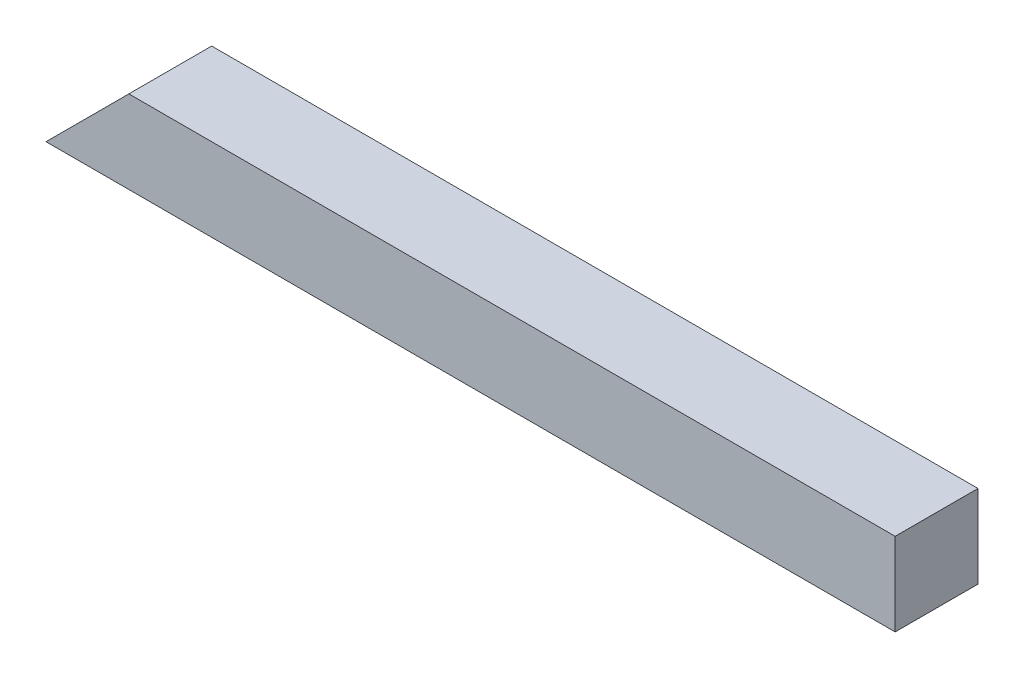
ISO-10303-21;
HEADER;
FILE_DESCRIPTION(('STEP AP214'),'2;1');
FILE_NAME('part.step','',(''),(''),'','','');
FILE_SCHEMA(('AUTOMOTIVE_DESIGN { 1 0 10303 214 1 1 1 1 }'));
ENDSEC;
DATA;
#1=APPLICATION_CONTEXT('core data for automotive mechanical design processes');
#2=APPLICATION_PROTOCOL_DEFINITION('international standard','automotive_design',2000,#1);
#3=PRODUCT_CONTEXT('',#1,'mechanical');
#4=PRODUCT('Part','Part','',(#3));
#5=PRODUCT_RELATED_PRODUCT_CATEGORY('part','',(#4));
#6=PRODUCT_DEFINITION_FORMATION('','',#4);
#7=PRODUCT_DEFINITION_CONTEXT('part definition',#1,'design');
#8=PRODUCT_DEFINITION('design','',#6,#7);
#9=PRODUCT_DEFINITION_SHAPE('','',#8);
#10=(LENGTH_UNIT() NAMED_UNIT(*) SI_UNIT(.MILLI.,.METRE.));
#11=(NAMED_UNIT(*) PLANE_ANGLE_UNIT() SI_UNIT($,.RADIAN.));
#12=(NAMED_UNIT(*) SI_UNIT($,.STERADIAN.) SOLID_ANGLE_UNIT());
#13=UNCERTAINTY_MEASURE_WITH_UNIT(LENGTH_MEASURE(1.E-05),#10,'distance_accuracy_value','');
#14=(GEOMETRIC_REPRESENTATION_CONTEXT(3) GLOBAL_UNCERTAINTY_ASSIGNED_CONTEXT((#13)) GLOBAL_UNIT_ASSIGNED_CONTEXT((#10,
#11,#12)) REPRESENTATION_CONTEXT('',''));
#15=CARTESIAN_POINT('',(0.,0.,0.));
#16=DIRECTION('',(0.,0.,1.));
#17=DIRECTION('',(1.,0.,0.));
#18=AXIS2_PLACEMENT_3D('',#15,#16,#17);
#19=CARTESIAN_POINT('',(0.,0.,-40.));
#20=DIRECTION('',(-0.707106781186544,0.707106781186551,0.));
#21=DIRECTION('',(-0.707106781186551,-0.707106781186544,0.));
#22=AXIS2_PLACEMENT_3D('',#19,#20,#21);
#23=PLANE('',#22);
#24=DIRECTION('',(-0.707106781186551,-0.707106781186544,0.));
#25=VECTOR('',#24,1.);
#26=CARTESIAN_POINT('',(0.,0.,0.));
#27=LINE('',#26,#25);
#28=CARTESIAN_POINT('',(40.0000000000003,39.9999999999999,0.));
#29=VERTEX_POINT('',#28);
#30=CARTESIAN_POINT('',(0.,0.,0.));
#31=VERTEX_POINT('',#30);
#32=EDGE_CURVE('E97',#29,#31,#27,.T.);
#33=ORIENTED_EDGE('',*,*,#32,.F.);
#34=DIRECTION('',(0.,0.,1.));
#35=VECTOR('',#34,1.);
#36=CARTESIAN_POINT('',(40.0000000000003,39.9999999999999,-40.));
#37=LINE('',#36,#35);
#38=CARTESIAN_POINT('',(40.0000000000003,39.9999999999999,-40.));
#39=VERTEX_POINT('',#38);
#40=EDGE_CURVE('E11',#39,#29,#37,.T.);
#41=ORIENTED_EDGE('',*,*,#40,.F.);
#42=DIRECTION('',(-0.707106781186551,-0.707106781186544,0.));
#43=VECTOR('',#42,1.);
#44=CARTESIAN_POINT('',(0.,0.,-40.));
#45=LINE('',#44,#43);
#46=CARTESIAN_POINT('',(0.,0.,-40.));
#47=VERTEX_POINT('',#46);
#48=EDGE_CURVE('E91',#39,#47,#45,.T.);
#49=ORIENTED_EDGE('',*,*,#48,.T.);
#50=DIRECTION('',(0.,0.,1.));
#51=VECTOR('',#50,1.);
#52=CARTESIAN_POINT('',(0.,0.,-40.));
#53=LINE('',#52,#51);
#54=EDGE_CURVE('E36',#47,#31,#53,.T.);
#55=ORIENTED_EDGE('',*,*,#54,.T.);
#56=EDGE_LOOP('',(#33,#41,#49,#55));
#57=FACE_BOUND('',#56,.T.);
#58=ADVANCED_FACE('F33',(#57),#23,.T.);
#59=CARTESIAN_POINT('',(40.0000000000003,39.9999999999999,-40.));
#60=DIRECTION('',(0.,1.,0.));
#61=DIRECTION('',(-1.,0.,0.));
#62=AXIS2_PLACEMENT_3D('',#59,#60,#61);
#63=PLANE('',#62);
#64=DIRECTION('',(-1.,0.,0.));
#65=VECTOR('',#64,1.);
#66=CARTESIAN_POINT('',(40.0000000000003,39.9999999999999,0.));
#67=LINE('',#66,#65);
#68=CARTESIAN_POINT('',(410.,40.,0.));
#69=VERTEX_POINT('',#68);
#70=EDGE_CURVE('E93',#69,#29,#67,.T.);
#71=ORIENTED_EDGE('',*,*,#70,.F.);
#72=DIRECTION('',(0.,0.,1.));
#73=VECTOR('',#72,1.);
#74=CARTESIAN_POINT('',(410.,40.,-40.));
#75=LINE('',#74,#73);
#76=CARTESIAN_POINT('',(410.,40.,-40.));
#77=VERTEX_POINT('',#76);
#78=EDGE_CURVE('E42',#77,#69,#75,.T.);
#79=ORIENTED_EDGE('',*,*,#78,.F.);
#80=DIRECTION('',(-1.,0.,0.));
#81=VECTOR('',#80,1.);
#82=CARTESIAN_POINT('',(40.0000000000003,39.9999999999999,-40.));
#83=LINE('',#82,#81);
#84=EDGE_CURVE('E88',#77,#39,#83,.T.);
#85=ORIENTED_EDGE('',*,*,#84,.T.);
#86=ORIENTED_EDGE('',*,*,#40,.T.);
#87=EDGE_LOOP('',(#71,#79,#85,#86));
#88=FACE_BOUND('',#87,.T.);
#89=ADVANCED_FACE('F107',(#88),#63,.T.);
#90=CARTESIAN_POINT('',(410.,40.,-40.));
#91=DIRECTION('',(1.,0.,0.));
#92=DIRECTION('',(0.,0.,-1.));
#93=AXIS2_PLACEMENT_3D('',#90,#91,#92);
#94=PLANE('',#93);
#95=DIRECTION('',(0.,1.,0.));
#96=VECTOR('',#95,1.);
#97=CARTESIAN_POINT('',(410.,40.,0.));
#98=LINE('',#97,#96);
#99=CARTESIAN_POINT('',(410.,0.,0.));
#100=VERTEX_POINT('',#99);
#101=EDGE_CURVE('E83',#100,#69,#98,.T.);
#102=ORIENTED_EDGE('',*,*,#101,.F.);
#103=DIRECTION('',(0.,0.,1.));
#104=VECTOR('',#103,1.);
#105=CARTESIAN_POINT('',(410.,0.,-40.));
#106=LINE('',#105,#104);
#107=CARTESIAN_POINT('',(410.,0.,-40.));
#108=VERTEX_POINT('',#107);
#109=EDGE_CURVE('E78',#108,#100,#106,.T.);
#110=ORIENTED_EDGE('',*,*,#109,.F.);
#111=DIRECTION('',(0.,1.,0.));
#112=VECTOR('',#111,1.);
#113=CARTESIAN_POINT('',(410.,40.,-40.));
#114=LINE('',#113,#112);
#115=EDGE_CURVE('E81',#108,#77,#114,.T.);
#116=ORIENTED_EDGE('',*,*,#115,.T.);
#117=ORIENTED_EDGE('',*,*,#78,.T.);
#118=EDGE_LOOP('',(#102,#110,#116,#117));
#119=FACE_BOUND('',#118,.T.);
#120=ADVANCED_FACE('F80',(#119),#94,.T.);
#121=CARTESIAN_POINT('',(410.,0.,-40.));
#122=DIRECTION('',(0.,-1.,0.));
#123=DIRECTION('',(0.,0.,-1.));
#124=AXIS2_PLACEMENT_3D('',#121,#122,#123);
#125=PLANE('',#124);
#126=DIRECTION('',(1.,0.,0.));
#127=VECTOR('',#126,1.);
#128=CARTESIAN_POINT('',(410.,0.,0.));
#129=LINE('',#128,#127);
#130=EDGE_CURVE('E100',#31,#100,#129,.T.);
#131=ORIENTED_EDGE('',*,*,#130,.F.);
#132=ORIENTED_EDGE('',*,*,#54,.F.);
#133=DIRECTION('',(1.,0.,0.));
#134=VECTOR('',#133,1.);
#135=CARTESIAN_POINT('',(410.,0.,-40.));
#136=LINE('',#135,#134);
#137=EDGE_CURVE('E87',#47,#108,#136,.T.);
#138=ORIENTED_EDGE('',*,*,#137,.T.);
#139=ORIENTED_EDGE('',*,*,#109,.T.);
#140=EDGE_LOOP('',(#131,#132,#138,#139));
#141=FACE_BOUND('',#140,.T.);
#142=ADVANCED_FACE('F90',(#141),#125,.T.);
#143=CARTESIAN_POINT('',(0.,0.,-40.));
#144=DIRECTION('',(0.,0.,-1.));
#145=DIRECTION('',(-1.,0.,0.));
#146=AXIS2_PLACEMENT_3D('',#143,#144,#145);
#147=PLANE('',#146);
#148=ORIENTED_EDGE('',*,*,#48,.F.);
#149=ORIENTED_EDGE('',*,*,#84,.F.);
#150=ORIENTED_EDGE('',*,*,#115,.F.);
#151=ORIENTED_EDGE('',*,*,#137,.F.);
#152=EDGE_LOOP('',(#148,#149,#150,#151));
#153=FACE_BOUND('',#152,.T.);
#154=ADVANCED_FACE('F86',(#153),#147,.T.);
#155=CARTESIAN_POINT('',(0.,0.,0.));
#156=DIRECTION('',(0.,0.,-1.));
#157=DIRECTION('',(-1.,0.,0.));
#158=AXIS2_PLACEMENT_3D('',#155,#156,#157);
#159=PLANE('',#158);
#160=ORIENTED_EDGE('',*,*,#32,.T.);
#161=ORIENTED_EDGE('',*,*,#130,.T.);
#162=ORIENTED_EDGE('',*,*,#101,.T.);
#163=ORIENTED_EDGE('',*,*,#70,.T.);
#164=EDGE_LOOP('',(#160,#161,#162,#163));
#165=FACE_BOUND('',#164,.T.);
#166=ADVANCED_FACE('F106',(#165),#159,.F.);
#167=CLOSED_SHELL('',(#58,#89,#120,#142,#154,#166));
#168=MANIFOLD_SOLID_BREP('B2',#167);
#169=ADVANCED_BREP_SHAPE_REPRESENTATION('',(#18,#168),#14);
#170=SHAPE_DEFINITION_REPRESENTATION(#9,#169);
ENDSEC;
END-ISO-10303-21;
